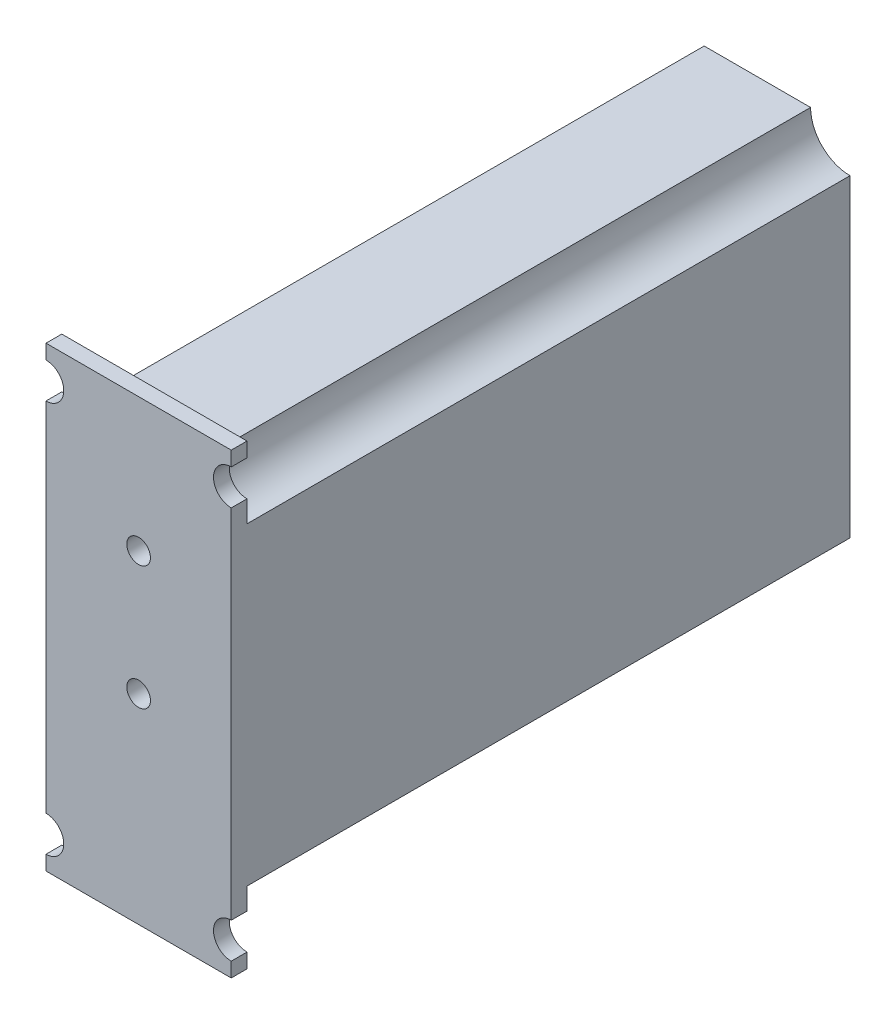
ISO-10303-21;
HEADER;
FILE_DESCRIPTION(('STEP AP214'),'2;1');
FILE_NAME('part.step','',(''),(''),'','','');
FILE_SCHEMA(('AUTOMOTIVE_DESIGN { 1 0 10303 214 1 1 1 1 }'));
ENDSEC;
DATA;
#1=APPLICATION_CONTEXT('core data for automotive mechanical design processes');
#2=APPLICATION_PROTOCOL_DEFINITION('international standard','automotive_design',2000,#1);
#3=PRODUCT_CONTEXT('',#1,'mechanical');
#4=PRODUCT('Part','Part','',(#3));
#5=PRODUCT_RELATED_PRODUCT_CATEGORY('part','',(#4));
#6=PRODUCT_DEFINITION_FORMATION('','',#4);
#7=PRODUCT_DEFINITION_CONTEXT('part definition',#1,'design');
#8=PRODUCT_DEFINITION('design','',#6,#7);
#9=PRODUCT_DEFINITION_SHAPE('','',#8);
#10=(LENGTH_UNIT() NAMED_UNIT(*) SI_UNIT(.MILLI.,.METRE.));
#11=(NAMED_UNIT(*) PLANE_ANGLE_UNIT() SI_UNIT($,.RADIAN.));
#12=(NAMED_UNIT(*) SI_UNIT($,.STERADIAN.) SOLID_ANGLE_UNIT());
#13=UNCERTAINTY_MEASURE_WITH_UNIT(LENGTH_MEASURE(1.E-05),#10,'distance_accuracy_value','');
#14=(GEOMETRIC_REPRESENTATION_CONTEXT(3) GLOBAL_UNCERTAINTY_ASSIGNED_CONTEXT((#13)) GLOBAL_UNIT_ASSIGNED_CONTEXT((#10,
#11,#12)) REPRESENTATION_CONTEXT('',''));
#15=CARTESIAN_POINT('',(0.,0.,0.));
#16=DIRECTION('',(0.,0.,1.));
#17=DIRECTION('',(1.,0.,0.));
#18=AXIS2_PLACEMENT_3D('',#15,#16,#17);
#19=CARTESIAN_POINT('',(-5.96899999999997,12.6492,38.862));
#20=DIRECTION('',(1.,0.,0.));
#21=DIRECTION('',(0.,0.,-0.999999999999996));
#22=AXIS2_PLACEMENT_3D('',#19,#20,#21);
#23=PLANE('',#22);
#24=DIRECTION('',(0.,-1.,0.));
#25=VECTOR('',#24,1.);
#26=CARTESIAN_POINT('',(-5.969,14.7319999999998,39.8779999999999));
#27=LINE('',#26,#25);
#28=CARTESIAN_POINT('',(-5.969,-13.7922,39.878));
#29=VERTEX_POINT('',#28);
#30=CARTESIAN_POINT('',(-5.969,-14.732,39.878));
#31=VERTEX_POINT('',#30);
#32=EDGE_CURVE('E339',#29,#31,#27,.T.);
#33=ORIENTED_EDGE('',*,*,#32,.F.);
#34=DIRECTION('',(0.,0.,-0.999999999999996));
#35=VECTOR('',#34,1.);
#36=CARTESIAN_POINT('',(-5.969,-13.7922,46.482));
#37=LINE('',#36,#35);
#38=CARTESIAN_POINT('',(-5.969,-13.7921999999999,38.862));
#39=VERTEX_POINT('',#38);
#40=EDGE_CURVE('E46',#29,#39,#37,.T.);
#41=ORIENTED_EDGE('',*,*,#40,.T.);
#42=DIRECTION('',(0.,-1.,0.));
#43=VECTOR('',#42,1.);
#44=CARTESIAN_POINT('',(-5.969,14.7319999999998,38.862));
#45=LINE('',#44,#43);
#46=CARTESIAN_POINT('',(-5.969,-14.732,38.862));
#47=VERTEX_POINT('',#46);
#48=EDGE_CURVE('E34',#39,#47,#45,.T.);
#49=ORIENTED_EDGE('',*,*,#48,.T.);
#50=DIRECTION('',(0.,0.,-0.999999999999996));
#51=VECTOR('',#50,1.);
#52=CARTESIAN_POINT('',(-5.969,-14.732,39.878));
#53=LINE('',#52,#51);
#54=EDGE_CURVE('E322',#31,#47,#53,.T.);
#55=ORIENTED_EDGE('',*,*,#54,.F.);
#56=EDGE_LOOP('',(#33,#41,#49,#55));
#57=FACE_BOUND('',#56,.T.);
#58=ADVANCED_FACE('F30',(#57),#23,.F.);
#59=CARTESIAN_POINT('',(5.969,12.6492,38.8619999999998));
#60=DIRECTION('',(-1.,0.,0.));
#61=DIRECTION('',(0.,0.,0.999999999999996));
#62=AXIS2_PLACEMENT_3D('',#59,#60,#61);
#63=PLANE('',#62);
#64=DIRECTION('',(0.,1.,0.));
#65=VECTOR('',#64,1.);
#66=CARTESIAN_POINT('',(5.969,14.732,39.8779999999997));
#67=LINE('',#66,#65);
#68=CARTESIAN_POINT('',(5.969,-11.5062,39.8779999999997));
#69=VERTEX_POINT('',#68);
#70=CARTESIAN_POINT('',(5.969,11.5062,39.8779999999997));
#71=VERTEX_POINT('',#70);
#72=EDGE_CURVE('E348',#69,#71,#67,.T.);
#73=ORIENTED_EDGE('',*,*,#72,.F.);
#74=DIRECTION('',(0.,0.,-0.999999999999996));
#75=VECTOR('',#74,1.);
#76=CARTESIAN_POINT('',(5.969,-11.5062,46.4819999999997));
#77=LINE('',#76,#75);
#78=CARTESIAN_POINT('',(5.96899999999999,-11.5062,38.8619999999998));
#79=VERTEX_POINT('',#78);
#80=EDGE_CURVE('E54',#69,#79,#77,.T.);
#81=ORIENTED_EDGE('',*,*,#80,.T.);
#82=DIRECTION('',(0.,1.,0.));
#83=VECTOR('',#82,1.);
#84=CARTESIAN_POINT('',(5.969,14.732,38.8619999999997));
#85=LINE('',#84,#83);
#86=CARTESIAN_POINT('',(5.96899999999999,-10.1092,38.8619999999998));
#87=VERTEX_POINT('',#86);
#88=EDGE_CURVE('E212',#79,#87,#85,.T.);
#89=ORIENTED_EDGE('',*,*,#88,.T.);
#90=DIRECTION('',(0.,0.,-0.999999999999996));
#91=VECTOR('',#90,1.);
#92=CARTESIAN_POINT('',(5.96899999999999,-10.1092,38.8619999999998));
#93=LINE('',#92,#91);
#94=CARTESIAN_POINT('',(5.96899999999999,-10.1092,0.));
#95=VERTEX_POINT('',#94);
#96=EDGE_CURVE('E238',#87,#95,#93,.T.);
#97=ORIENTED_EDGE('',*,*,#96,.T.);
#98=DIRECTION('',(0.,1.,0.));
#99=VECTOR('',#98,1.);
#100=CARTESIAN_POINT('',(5.969,12.6492,0.));
#101=LINE('',#100,#99);
#102=CARTESIAN_POINT('',(5.969,10.1092,0.));
#103=VERTEX_POINT('',#102);
#104=EDGE_CURVE('E247',#95,#103,#101,.T.);
#105=ORIENTED_EDGE('',*,*,#104,.T.);
#106=DIRECTION('',(0.,0.,-0.999999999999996));
#107=VECTOR('',#106,1.);
#108=CARTESIAN_POINT('',(5.96899999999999,10.1092,38.8619999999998));
#109=LINE('',#108,#107);
#110=CARTESIAN_POINT('',(5.96899999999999,10.1092,38.8619999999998));
#111=VERTEX_POINT('',#110);
#112=EDGE_CURVE('E244',#103,#111,#109,.F.);
#113=ORIENTED_EDGE('',*,*,#112,.T.);
#114=CARTESIAN_POINT('',(5.969,11.5062,38.8619999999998));
#115=VERTEX_POINT('',#114);
#116=EDGE_CURVE('E214',#111,#115,#85,.T.);
#117=ORIENTED_EDGE('',*,*,#116,.T.);
#118=DIRECTION('',(0.,0.,-0.999999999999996));
#119=VECTOR('',#118,1.);
#120=CARTESIAN_POINT('',(5.969,11.5062,46.4819999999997));
#121=LINE('',#120,#119);
#122=EDGE_CURVE('E354',#115,#71,#121,.F.);
#123=ORIENTED_EDGE('',*,*,#122,.T.);
#124=EDGE_LOOP('',(#73,#81,#89,#97,#105,#113,#117,#123));
#125=FACE_BOUND('',#124,.T.);
#126=ADVANCED_FACE('F406',(#125),#63,.F.);
#127=CARTESIAN_POINT('',(-5.96899999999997,-10.1092000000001,38.862));
#128=VERTEX_POINT('',#127);
#129=CARTESIAN_POINT('',(-5.969,-11.5062,38.862));
#130=VERTEX_POINT('',#129);
#131=EDGE_CURVE('E180',#128,#130,#45,.T.);
#132=ORIENTED_EDGE('',*,*,#131,.T.);
#133=DIRECTION('',(0.,0.,-0.999999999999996));
#134=VECTOR('',#133,1.);
#135=CARTESIAN_POINT('',(-5.969,-11.5062,46.482));
#136=LINE('',#135,#134);
#137=CARTESIAN_POINT('',(-5.969,-11.5062,39.878));
#138=VERTEX_POINT('',#137);
#139=EDGE_CURVE('E166',#130,#138,#136,.F.);
#140=ORIENTED_EDGE('',*,*,#139,.T.);
#141=CARTESIAN_POINT('',(-5.969,11.5062,39.878));
#142=VERTEX_POINT('',#141);
#143=EDGE_CURVE('E338',#142,#138,#27,.T.);
#144=ORIENTED_EDGE('',*,*,#143,.F.);
#145=DIRECTION('',(0.,0.,-0.999999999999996));
#146=VECTOR('',#145,1.);
#147=CARTESIAN_POINT('',(-5.969,11.5062,46.4819999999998));
#148=LINE('',#147,#146);
#149=CARTESIAN_POINT('',(-5.969,11.5062,38.862));
#150=VERTEX_POINT('',#149);
#151=EDGE_CURVE('E359',#142,#150,#148,.T.);
#152=ORIENTED_EDGE('',*,*,#151,.T.);
#153=CARTESIAN_POINT('',(-5.969,10.1092,38.862));
#154=VERTEX_POINT('',#153);
#155=EDGE_CURVE('E188',#150,#154,#45,.T.);
#156=ORIENTED_EDGE('',*,*,#155,.T.);
#157=DIRECTION('',(0.,0.,-0.999999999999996));
#158=VECTOR('',#157,1.);
#159=CARTESIAN_POINT('',(-5.969,10.1092,38.862));
#160=LINE('',#159,#158);
#161=CARTESIAN_POINT('',(-5.969,10.1092,0.));
#162=VERTEX_POINT('',#161);
#163=EDGE_CURVE('E259',#154,#162,#160,.T.);
#164=ORIENTED_EDGE('',*,*,#163,.T.);
#165=DIRECTION('',(0.,-1.,0.));
#166=VECTOR('',#165,1.);
#167=CARTESIAN_POINT('',(-5.96899999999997,12.6492,0.));
#168=LINE('',#167,#166);
#169=CARTESIAN_POINT('',(-5.96899999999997,-10.1092000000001,0.));
#170=VERTEX_POINT('',#169);
#171=EDGE_CURVE('E284',#162,#170,#168,.T.);
#172=ORIENTED_EDGE('',*,*,#171,.T.);
#173=DIRECTION('',(0.,0.,-0.999999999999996));
#174=VECTOR('',#173,1.);
#175=CARTESIAN_POINT('',(-5.96899999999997,-10.1092000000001,38.862));
#176=LINE('',#175,#174);
#177=EDGE_CURVE('E187',#170,#128,#176,.F.);
#178=ORIENTED_EDGE('',*,*,#177,.T.);
#179=EDGE_LOOP('',(#132,#140,#144,#152,#156,#164,#172,#178));
#180=FACE_BOUND('',#179,.T.);
#181=ADVANCED_FACE('F185',(#180),#23,.F.);
#182=CARTESIAN_POINT('',(5.96899999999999,13.7921999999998,39.8779999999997));
#183=VERTEX_POINT('',#182);
#184=CARTESIAN_POINT('',(5.969,14.732,39.8779999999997));
#185=VERTEX_POINT('',#184);
#186=EDGE_CURVE('E350',#183,#185,#67,.T.);
#187=ORIENTED_EDGE('',*,*,#186,.F.);
#188=DIRECTION('',(0.,0.,-0.999999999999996));
#189=VECTOR('',#188,1.);
#190=CARTESIAN_POINT('',(5.96899999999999,13.7921999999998,46.4819999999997));
#191=LINE('',#190,#189);
#192=CARTESIAN_POINT('',(5.969,13.7921999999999,38.8619999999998));
#193=VERTEX_POINT('',#192);
#194=EDGE_CURVE('E226',#183,#193,#191,.T.);
#195=ORIENTED_EDGE('',*,*,#194,.T.);
#196=CARTESIAN_POINT('',(5.969,14.732,38.8619999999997));
#197=VERTEX_POINT('',#196);
#198=EDGE_CURVE('E224',#193,#197,#85,.T.);
#199=ORIENTED_EDGE('',*,*,#198,.T.);
#200=DIRECTION('',(0.,0.,-0.999999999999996));
#201=VECTOR('',#200,1.);
#202=CARTESIAN_POINT('',(5.969,14.732,39.8779999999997));
#203=LINE('',#202,#201);
#204=EDGE_CURVE('E313',#185,#197,#203,.T.);
#205=ORIENTED_EDGE('',*,*,#204,.F.);
#206=EDGE_LOOP('',(#187,#195,#199,#205));
#207=FACE_BOUND('',#206,.T.);
#208=ADVANCED_FACE('F436',(#207),#63,.F.);
#209=CARTESIAN_POINT('',(5.96899999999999,-14.732,38.8619999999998));
#210=VERTEX_POINT('',#209);
#211=CARTESIAN_POINT('',(5.96899999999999,-13.7922000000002,38.8619999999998));
#212=VERTEX_POINT('',#211);
#213=EDGE_CURVE('E213',#210,#212,#85,.T.);
#214=ORIENTED_EDGE('',*,*,#213,.T.);
#215=DIRECTION('',(0.,0.,-0.999999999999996));
#216=VECTOR('',#215,1.);
#217=CARTESIAN_POINT('',(5.96899999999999,-13.7922000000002,46.4819999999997));
#218=LINE('',#217,#216);
#219=CARTESIAN_POINT('',(5.96899999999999,-13.7922000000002,39.8779999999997));
#220=VERTEX_POINT('',#219);
#221=EDGE_CURVE('E367',#212,#220,#218,.F.);
#222=ORIENTED_EDGE('',*,*,#221,.T.);
#223=CARTESIAN_POINT('',(5.96899999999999,-14.732,39.8779999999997));
#224=VERTEX_POINT('',#223);
#225=EDGE_CURVE('E346',#224,#220,#67,.T.);
#226=ORIENTED_EDGE('',*,*,#225,.F.);
#227=DIRECTION('',(0.,0.,-0.999999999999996));
#228=VECTOR('',#227,1.);
#229=CARTESIAN_POINT('',(5.96899999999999,-14.732,39.8779999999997));
#230=LINE('',#229,#228);
#231=EDGE_CURVE('E326',#224,#210,#230,.T.);
#232=ORIENTED_EDGE('',*,*,#231,.T.);
#233=EDGE_LOOP('',(#214,#222,#226,#232));
#234=FACE_BOUND('',#233,.T.);
#235=ADVANCED_FACE('F32',(#234),#63,.F.);
#236=CARTESIAN_POINT('',(-5.96899999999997,12.6492,38.862));
#237=DIRECTION('',(0.,-1.,0.));
#238=DIRECTION('',(0.,0.,-0.999999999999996));
#239=AXIS2_PLACEMENT_3D('',#236,#237,#238);
#240=PLANE('',#239);
#241=DIRECTION('',(-1.,0.,0.));
#242=VECTOR('',#241,1.);
#243=CARTESIAN_POINT('',(-5.96899999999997,12.6492,0.));
#244=LINE('',#243,#242);
#245=CARTESIAN_POINT('',(3.429,12.6492,0.));
#246=VERTEX_POINT('',#245);
#247=CARTESIAN_POINT('',(-3.429,12.6492,0.));
#248=VERTEX_POINT('',#247);
#249=EDGE_CURVE('E281',#246,#248,#244,.T.);
#250=ORIENTED_EDGE('',*,*,#249,.T.);
#251=DIRECTION('',(0.,0.,-0.999999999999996));
#252=VECTOR('',#251,1.);
#253=CARTESIAN_POINT('',(-3.429,12.6492,38.862));
#254=LINE('',#253,#252);
#255=CARTESIAN_POINT('',(-3.429,12.6492,38.862));
#256=VERTEX_POINT('',#255);
#257=EDGE_CURVE('E254',#248,#256,#254,.F.);
#258=ORIENTED_EDGE('',*,*,#257,.T.);
#259=DIRECTION('',(-1.,0.,0.));
#260=VECTOR('',#259,1.);
#261=CARTESIAN_POINT('',(-5.96899999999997,12.6492,38.862));
#262=LINE('',#261,#260);
#263=CARTESIAN_POINT('',(3.429,12.6492,38.862));
#264=VERTEX_POINT('',#263);
#265=EDGE_CURVE('E273',#264,#256,#262,.T.);
#266=ORIENTED_EDGE('',*,*,#265,.F.);
#267=DIRECTION('',(0.,0.,-0.999999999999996));
#268=VECTOR('',#267,1.);
#269=CARTESIAN_POINT('',(3.429,12.6492,38.862));
#270=LINE('',#269,#268);
#271=EDGE_CURVE('E248',#264,#246,#270,.T.);
#272=ORIENTED_EDGE('',*,*,#271,.T.);
#273=EDGE_LOOP('',(#250,#258,#266,#272));
#274=FACE_BOUND('',#273,.T.);
#275=ADVANCED_FACE('F441',(#274),#240,.F.);
#276=CARTESIAN_POINT('',(-5.969,14.7319999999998,38.862));
#277=VERTEX_POINT('',#276);
#278=CARTESIAN_POINT('',(-5.96900000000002,13.7922,38.862));
#279=VERTEX_POINT('',#278);
#280=EDGE_CURVE('E190',#277,#279,#45,.T.);
#281=ORIENTED_EDGE('',*,*,#280,.T.);
#282=DIRECTION('',(0.,0.,-0.999999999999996));
#283=VECTOR('',#282,1.);
#284=CARTESIAN_POINT('',(-5.969,13.7922,46.4819999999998));
#285=LINE('',#284,#283);
#286=CARTESIAN_POINT('',(-5.96900000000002,13.7922,39.8779999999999));
#287=VERTEX_POINT('',#286);
#288=EDGE_CURVE('E361',#279,#287,#285,.F.);
#289=ORIENTED_EDGE('',*,*,#288,.T.);
#290=CARTESIAN_POINT('',(-5.969,14.7319999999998,39.8779999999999));
#291=VERTEX_POINT('',#290);
#292=EDGE_CURVE('E333',#291,#287,#27,.T.);
#293=ORIENTED_EDGE('',*,*,#292,.F.);
#294=DIRECTION('',(0.,0.,-0.999999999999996));
#295=VECTOR('',#294,1.);
#296=CARTESIAN_POINT('',(-5.969,14.7319999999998,39.8779999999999));
#297=LINE('',#296,#295);
#298=EDGE_CURVE('E317',#291,#277,#297,.T.);
#299=ORIENTED_EDGE('',*,*,#298,.T.);
#300=EDGE_LOOP('',(#281,#289,#293,#299));
#301=FACE_BOUND('',#300,.T.);
#302=ADVANCED_FACE('F413',(#301),#23,.F.);
#303=CARTESIAN_POINT('',(-5.96899999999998,-12.6492,38.862));
#304=DIRECTION('',(0.,1.,0.));
#305=DIRECTION('',(0.,0.,0.999999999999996));
#306=AXIS2_PLACEMENT_3D('',#303,#304,#305);
#307=PLANE('',#306);
#308=DIRECTION('',(1.,0.,0.));
#309=VECTOR('',#308,1.);
#310=CARTESIAN_POINT('',(-5.96899999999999,-12.6492,0.));
#311=LINE('',#310,#309);
#312=CARTESIAN_POINT('',(-3.429,-12.6491999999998,2.22044604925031E-13));
#313=VERTEX_POINT('',#312);
#314=CARTESIAN_POINT('',(3.429,-12.6492,0.));
#315=VERTEX_POINT('',#314);
#316=EDGE_CURVE('E277',#313,#315,#311,.T.);
#317=ORIENTED_EDGE('',*,*,#316,.T.);
#318=DIRECTION('',(0.,0.,-0.999999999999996));
#319=VECTOR('',#318,1.);
#320=CARTESIAN_POINT('',(3.429,-12.6492,38.862));
#321=LINE('',#320,#319);
#322=CARTESIAN_POINT('',(3.429,-12.6492,38.862));
#323=VERTEX_POINT('',#322);
#324=EDGE_CURVE('E234',#315,#323,#321,.F.);
#325=ORIENTED_EDGE('',*,*,#324,.T.);
#326=DIRECTION('',(1.,0.,0.));
#327=VECTOR('',#326,1.);
#328=CARTESIAN_POINT('',(-5.96899999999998,-12.6492,38.862));
#329=LINE('',#328,#327);
#330=CARTESIAN_POINT('',(-3.429,-12.6491999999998,38.862));
#331=VERTEX_POINT('',#330);
#332=EDGE_CURVE('E276',#331,#323,#329,.T.);
#333=ORIENTED_EDGE('',*,*,#332,.F.);
#334=DIRECTION('',(0.,0.,-0.999999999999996));
#335=VECTOR('',#334,1.);
#336=CARTESIAN_POINT('',(-3.429,-12.6491999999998,38.862));
#337=LINE('',#336,#335);
#338=EDGE_CURVE('E266',#331,#313,#337,.T.);
#339=ORIENTED_EDGE('',*,*,#338,.T.);
#340=EDGE_LOOP('',(#317,#325,#333,#339));
#341=FACE_BOUND('',#340,.T.);
#342=ADVANCED_FACE('F440',(#341),#307,.F.);
#343=CARTESIAN_POINT('',(5.96899999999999,-12.6492,0.));
#344=DIRECTION('',(0.,0.,0.999999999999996));
#345=DIRECTION('',(1.,0.,0.));
#346=AXIS2_PLACEMENT_3D('',#343,#344,#345);
#347=PLANE('',#346);
#348=ORIENTED_EDGE('',*,*,#104,.F.);
#349=CARTESIAN_POINT('',(5.96899999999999,-12.6492,0.));
#350=DIRECTION('',(0.,0.,-0.999999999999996));
#351=DIRECTION('',(1.,0.,0.));
#352=AXIS2_PLACEMENT_3D('',#349,#350,#351);
#353=CIRCLE('',#352,2.54);
#354=EDGE_CURVE('E235',#315,#95,#353,.T.);
#355=ORIENTED_EDGE('',*,*,#354,.F.);
#356=ORIENTED_EDGE('',*,*,#316,.F.);
#357=CARTESIAN_POINT('',(-5.96899999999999,-12.6492,0.));
#358=DIRECTION('',(0.,0.,-0.999999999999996));
#359=DIRECTION('',(-1.,0.,0.));
#360=AXIS2_PLACEMENT_3D('',#357,#358,#359);
#361=CIRCLE('',#360,2.54);
#362=EDGE_CURVE('E241',#170,#313,#361,.T.);
#363=ORIENTED_EDGE('',*,*,#362,.F.);
#364=ORIENTED_EDGE('',*,*,#171,.F.);
#365=CARTESIAN_POINT('',(-5.96899999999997,12.6492,0.));
#366=DIRECTION('',(0.,0.,-0.999999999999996));
#367=DIRECTION('',(1.,0.,0.));
#368=AXIS2_PLACEMENT_3D('',#365,#366,#367);
#369=CIRCLE('',#368,2.54);
#370=EDGE_CURVE('E260',#248,#162,#369,.T.);
#371=ORIENTED_EDGE('',*,*,#370,.F.);
#372=ORIENTED_EDGE('',*,*,#249,.F.);
#373=CARTESIAN_POINT('',(5.969,12.6492,0.));
#374=DIRECTION('',(0.,0.,0.999999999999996));
#375=DIRECTION('',(1.,0.,0.));
#376=AXIS2_PLACEMENT_3D('',#373,#374,#375);
#377=CIRCLE('',#376,2.54);
#378=EDGE_CURVE('E230',#246,#103,#377,.T.);
#379=ORIENTED_EDGE('',*,*,#378,.T.);
#380=EDGE_LOOP('',(#348,#355,#356,#363,#364,#371,#372,#379));
#381=FACE_BOUND('',#380,.T.);
#382=ADVANCED_FACE('F306',(#381),#347,.F.);
#383=CARTESIAN_POINT('',(5.969,12.6492,38.8619999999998));
#384=DIRECTION('',(0.,0.,-0.999999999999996));
#385=DIRECTION('',(-1.,0.,0.));
#386=AXIS2_PLACEMENT_3D('',#383,#384,#385);
#387=CYLINDRICAL_SURFACE('',#386,2.54);
#388=ORIENTED_EDGE('',*,*,#378,.F.);
#389=ORIENTED_EDGE('',*,*,#271,.F.);
#390=CARTESIAN_POINT('',(5.969,12.6492,38.8619999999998));
#391=DIRECTION('',(0.,0.,-0.999999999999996));
#392=DIRECTION('',(-1.,0.,0.));
#393=AXIS2_PLACEMENT_3D('',#390,#391,#392);
#394=CIRCLE('',#393,2.54);
#395=EDGE_CURVE('E251',#111,#264,#394,.T.);
#396=ORIENTED_EDGE('',*,*,#395,.F.);
#397=ORIENTED_EDGE('',*,*,#112,.F.);
#398=EDGE_LOOP('',(#388,#389,#396,#397));
#399=FACE_BOUND('',#398,.T.);
#400=ADVANCED_FACE('F454',(#399),#387,.F.);
#401=CARTESIAN_POINT('',(-5.96899999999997,12.6492,38.862));
#402=DIRECTION('',(0.,0.,-0.999999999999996));
#403=DIRECTION('',(-1.,0.,0.));
#404=AXIS2_PLACEMENT_3D('',#401,#402,#403);
#405=CYLINDRICAL_SURFACE('',#404,2.54);
#406=ORIENTED_EDGE('',*,*,#370,.T.);
#407=ORIENTED_EDGE('',*,*,#163,.F.);
#408=CARTESIAN_POINT('',(-5.96899999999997,12.6492,38.862));
#409=DIRECTION('',(0.,0.,-0.999999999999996));
#410=DIRECTION('',(1.,0.,0.));
#411=AXIS2_PLACEMENT_3D('',#408,#409,#410);
#412=CIRCLE('',#411,2.54);
#413=EDGE_CURVE('E255',#256,#154,#412,.T.);
#414=ORIENTED_EDGE('',*,*,#413,.F.);
#415=ORIENTED_EDGE('',*,*,#257,.F.);
#416=EDGE_LOOP('',(#406,#407,#414,#415));
#417=FACE_BOUND('',#416,.T.);
#418=ADVANCED_FACE('F580',(#417),#405,.F.);
#419=CARTESIAN_POINT('',(-5.96899999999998,-12.6492,38.862));
#420=DIRECTION('',(0.,0.,-0.999999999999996));
#421=DIRECTION('',(-1.,0.,0.));
#422=AXIS2_PLACEMENT_3D('',#419,#420,#421);
#423=CYLINDRICAL_SURFACE('',#422,2.54);
#424=ORIENTED_EDGE('',*,*,#362,.T.);
#425=ORIENTED_EDGE('',*,*,#338,.F.);
#426=CARTESIAN_POINT('',(-5.96899999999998,-12.6492,38.862));
#427=DIRECTION('',(0.,0.,-0.999999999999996));
#428=DIRECTION('',(-1.,0.,0.));
#429=AXIS2_PLACEMENT_3D('',#426,#427,#428);
#430=CIRCLE('',#429,2.54);
#431=EDGE_CURVE('E290',#128,#331,#430,.T.);
#432=ORIENTED_EDGE('',*,*,#431,.F.);
#433=ORIENTED_EDGE('',*,*,#177,.F.);
#434=EDGE_LOOP('',(#424,#425,#432,#433));
#435=FACE_BOUND('',#434,.T.);
#436=ADVANCED_FACE('F577',(#435),#423,.F.);
#437=CARTESIAN_POINT('',(5.96899999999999,-12.6492,38.8619999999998));
#438=DIRECTION('',(0.,0.,-0.999999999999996));
#439=DIRECTION('',(-1.,0.,0.));
#440=AXIS2_PLACEMENT_3D('',#437,#438,#439);
#441=CYLINDRICAL_SURFACE('',#440,2.54);
#442=CARTESIAN_POINT('',(5.96899999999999,-12.6492,38.8619999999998));
#443=DIRECTION('',(0.,0.,-0.999999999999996));
#444=DIRECTION('',(1.,0.,0.));
#445=AXIS2_PLACEMENT_3D('',#442,#443,#444);
#446=CIRCLE('',#445,2.54);
#447=EDGE_CURVE('E231',#323,#87,#446,.T.);
#448=ORIENTED_EDGE('',*,*,#447,.F.);
#449=ORIENTED_EDGE('',*,*,#324,.F.);
#450=ORIENTED_EDGE('',*,*,#354,.T.);
#451=ORIENTED_EDGE('',*,*,#96,.F.);
#452=EDGE_LOOP('',(#448,#449,#450,#451));
#453=FACE_BOUND('',#452,.T.);
#454=ADVANCED_FACE('F475',(#453),#441,.F.);
#455=CARTESIAN_POINT('',(5.96899999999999,-14.732,38.8619999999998));
#456=DIRECTION('',(0.,0.,0.999999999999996));
#457=DIRECTION('',(1.,0.,0.));
#458=AXIS2_PLACEMENT_3D('',#455,#456,#457);
#459=PLANE('',#458);
#460=ORIENTED_EDGE('',*,*,#155,.F.);
#461=CARTESIAN_POINT('',(-5.96899999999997,12.6492,38.862));
#462=DIRECTION('',(0.,0.,-0.999999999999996));
#463=DIRECTION('',(1.,0.,0.));
#464=AXIS2_PLACEMENT_3D('',#461,#462,#463);
#465=CIRCLE('',#464,1.143);
#466=EDGE_CURVE('E364',#279,#150,#465,.T.);
#467=ORIENTED_EDGE('',*,*,#466,.F.);
#468=ORIENTED_EDGE('',*,*,#280,.F.);
#469=DIRECTION('',(-1.,0.,0.));
#470=VECTOR('',#469,1.);
#471=CARTESIAN_POINT('',(-5.969,14.7319999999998,38.862));
#472=LINE('',#471,#470);
#473=EDGE_CURVE('E192',#197,#277,#472,.T.);
#474=ORIENTED_EDGE('',*,*,#473,.F.);
#475=ORIENTED_EDGE('',*,*,#198,.F.);
#476=CARTESIAN_POINT('',(5.969,12.6492,38.8619999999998));
#477=DIRECTION('',(0.,0.,-0.999999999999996));
#478=DIRECTION('',(-1.,0.,0.));
#479=AXIS2_PLACEMENT_3D('',#476,#477,#478);
#480=CIRCLE('',#479,1.143);
#481=EDGE_CURVE('E357',#115,#193,#480,.T.);
#482=ORIENTED_EDGE('',*,*,#481,.F.);
#483=ORIENTED_EDGE('',*,*,#116,.F.);
#484=ORIENTED_EDGE('',*,*,#395,.T.);
#485=ORIENTED_EDGE('',*,*,#265,.T.);
#486=ORIENTED_EDGE('',*,*,#413,.T.);
#487=EDGE_LOOP('',(#460,#467,#468,#474,#475,#482,#483,#484,#485,#486));
#488=FACE_BOUND('',#487,.T.);
#489=ADVANCED_FACE('F417',(#488),#459,.F.);
#490=ORIENTED_EDGE('',*,*,#48,.F.);
#491=CARTESIAN_POINT('',(-5.96899999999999,-12.6492,38.862));
#492=DIRECTION('',(0.,0.,-0.999999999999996));
#493=DIRECTION('',(-1.,0.,0.));
#494=AXIS2_PLACEMENT_3D('',#491,#492,#493);
#495=CIRCLE('',#494,1.143);
#496=EDGE_CURVE('E169',#130,#39,#495,.T.);
#497=ORIENTED_EDGE('',*,*,#496,.F.);
#498=ORIENTED_EDGE('',*,*,#131,.F.);
#499=ORIENTED_EDGE('',*,*,#431,.T.);
#500=ORIENTED_EDGE('',*,*,#332,.T.);
#501=ORIENTED_EDGE('',*,*,#447,.T.);
#502=ORIENTED_EDGE('',*,*,#88,.F.);
#503=CARTESIAN_POINT('',(5.96899999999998,-12.6492,38.8619999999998));
#504=DIRECTION('',(0.,0.,-0.999999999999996));
#505=DIRECTION('',(1.,0.,0.));
#506=AXIS2_PLACEMENT_3D('',#503,#504,#505);
#507=CIRCLE('',#506,1.143);
#508=EDGE_CURVE('E370',#212,#79,#507,.T.);
#509=ORIENTED_EDGE('',*,*,#508,.F.);
#510=ORIENTED_EDGE('',*,*,#213,.F.);
#511=DIRECTION('',(1.,0.,0.));
#512=VECTOR('',#511,1.);
#513=CARTESIAN_POINT('',(-5.969,-14.732,38.862));
#514=LINE('',#513,#512);
#515=EDGE_CURVE('E202',#47,#210,#514,.T.);
#516=ORIENTED_EDGE('',*,*,#515,.F.);
#517=EDGE_LOOP('',(#490,#497,#498,#499,#500,#501,#502,#509,#510,#516));
#518=FACE_BOUND('',#517,.T.);
#519=ADVANCED_FACE('F178',(#518),#459,.F.);
#520=CARTESIAN_POINT('',(-5.969,14.7319999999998,39.8779999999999));
#521=DIRECTION('',(0.,-1.,0.));
#522=DIRECTION('',(0.,0.,-0.999999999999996));
#523=AXIS2_PLACEMENT_3D('',#520,#521,#522);
#524=PLANE('',#523);
#525=ORIENTED_EDGE('',*,*,#473,.T.);
#526=ORIENTED_EDGE('',*,*,#298,.F.);
#527=DIRECTION('',(-1.,0.,0.));
#528=VECTOR('',#527,1.);
#529=CARTESIAN_POINT('',(-5.969,14.7319999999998,39.8779999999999));
#530=LINE('',#529,#528);
#531=EDGE_CURVE('E343',#185,#291,#530,.T.);
#532=ORIENTED_EDGE('',*,*,#531,.F.);
#533=ORIENTED_EDGE('',*,*,#204,.T.);
#534=EDGE_LOOP('',(#525,#526,#532,#533));
#535=FACE_BOUND('',#534,.T.);
#536=ADVANCED_FACE('F497',(#535),#524,.F.);
#537=CARTESIAN_POINT('',(-5.969,-14.732,39.878));
#538=DIRECTION('',(0.,1.,0.));
#539=DIRECTION('',(0.,0.,0.999999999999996));
#540=AXIS2_PLACEMENT_3D('',#537,#538,#539);
#541=PLANE('',#540);
#542=ORIENTED_EDGE('',*,*,#515,.T.);
#543=ORIENTED_EDGE('',*,*,#231,.F.);
#544=DIRECTION('',(1.,0.,0.));
#545=VECTOR('',#544,1.);
#546=CARTESIAN_POINT('',(-5.969,-14.732,39.878));
#547=LINE('',#546,#545);
#548=EDGE_CURVE('E217',#31,#224,#547,.T.);
#549=ORIENTED_EDGE('',*,*,#548,.F.);
#550=ORIENTED_EDGE('',*,*,#54,.T.);
#551=EDGE_LOOP('',(#542,#543,#549,#550));
#552=FACE_BOUND('',#551,.T.);
#553=ADVANCED_FACE('F398',(#552),#541,.F.);
#554=CARTESIAN_POINT('',(5.96899999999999,-14.732,39.8779999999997));
#555=DIRECTION('',(0.,0.,0.999999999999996));
#556=DIRECTION('',(1.,0.,0.));
#557=AXIS2_PLACEMENT_3D('',#554,#555,#556);
#558=PLANE('',#557);
#559=CARTESIAN_POINT('',(0.,-1.85420000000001,39.8779999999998));
#560=DIRECTION('',(0.,0.,0.999999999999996));
#561=DIRECTION('',(-1.,0.,0.));
#562=AXIS2_PLACEMENT_3D('',#559,#560,#561);
#563=CIRCLE('',#562,0.762);
#564=CARTESIAN_POINT('',(0.761999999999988,-1.85419999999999,39.8779999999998));
#565=VERTEX_POINT('',#564);
#566=EDGE_CURVE('E379',#565,#565,#563,.T.);
#567=ORIENTED_EDGE('',*,*,#566,.F.);
#568=EDGE_LOOP('',(#567));
#569=FACE_BOUND('',#568,.T.);
#570=CARTESIAN_POINT('',(0.,6.12139999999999,39.8779999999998));
#571=DIRECTION('',(0.,0.,0.999999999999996));
#572=DIRECTION('',(1.,0.,0.));
#573=AXIS2_PLACEMENT_3D('',#570,#571,#572);
#574=CIRCLE('',#573,0.762);
#575=CARTESIAN_POINT('',(0.762000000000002,6.12140000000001,39.8779999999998));
#576=VERTEX_POINT('',#575);
#577=EDGE_CURVE('E373',#576,#576,#574,.T.);
#578=ORIENTED_EDGE('',*,*,#577,.F.);
#579=EDGE_LOOP('',(#578));
#580=FACE_BOUND('',#579,.T.);
#581=CARTESIAN_POINT('',(-5.96899999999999,-12.6492,39.878));
#582=DIRECTION('',(0.,0.,0.999999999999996));
#583=DIRECTION('',(1.,0.,0.));
#584=AXIS2_PLACEMENT_3D('',#581,#582,#583);
#585=CIRCLE('',#584,1.143);
#586=EDGE_CURVE('E11',#29,#138,#585,.T.);
#587=ORIENTED_EDGE('',*,*,#586,.F.);
#588=ORIENTED_EDGE('',*,*,#32,.T.);
#589=ORIENTED_EDGE('',*,*,#548,.T.);
#590=ORIENTED_EDGE('',*,*,#225,.T.);
#591=CARTESIAN_POINT('',(5.96899999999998,-12.6492,39.8779999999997));
#592=DIRECTION('',(0.,0.,0.999999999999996));
#593=DIRECTION('',(1.,0.,0.));
#594=AXIS2_PLACEMENT_3D('',#591,#592,#593);
#595=CIRCLE('',#594,1.143);
#596=EDGE_CURVE('E40',#69,#220,#595,.T.);
#597=ORIENTED_EDGE('',*,*,#596,.F.);
#598=ORIENTED_EDGE('',*,*,#72,.T.);
#599=CARTESIAN_POINT('',(5.969,12.6492,39.8779999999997));
#600=DIRECTION('',(0.,0.,0.999999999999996));
#601=DIRECTION('',(1.,0.,0.));
#602=AXIS2_PLACEMENT_3D('',#599,#600,#601);
#603=CIRCLE('',#602,1.143);
#604=EDGE_CURVE('E227',#183,#71,#603,.T.);
#605=ORIENTED_EDGE('',*,*,#604,.F.);
#606=ORIENTED_EDGE('',*,*,#186,.T.);
#607=ORIENTED_EDGE('',*,*,#531,.T.);
#608=ORIENTED_EDGE('',*,*,#292,.T.);
#609=CARTESIAN_POINT('',(-5.96899999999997,12.6492,39.878));
#610=DIRECTION('',(0.,0.,0.999999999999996));
#611=DIRECTION('',(1.,0.,0.));
#612=AXIS2_PLACEMENT_3D('',#609,#610,#611);
#613=CIRCLE('',#612,1.143);
#614=EDGE_CURVE('E209',#142,#287,#613,.T.);
#615=ORIENTED_EDGE('',*,*,#614,.F.);
#616=ORIENTED_EDGE('',*,*,#143,.T.);
#617=EDGE_LOOP('',(#587,#588,#589,#590,#597,#598,#605,#606,#607,#608,#615,#616));
#618=FACE_BOUND('',#617,.T.);
#619=ADVANCED_FACE('F394',(#569,#580,#618),#558,.T.);
#620=CARTESIAN_POINT('',(5.969,12.6492,46.4819999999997));
#621=DIRECTION('',(0.,0.,-0.999999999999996));
#622=DIRECTION('',(-1.,0.,0.));
#623=AXIS2_PLACEMENT_3D('',#620,#621,#622);
#624=CYLINDRICAL_SURFACE('',#623,1.143);
#625=ORIENTED_EDGE('',*,*,#604,.T.);
#626=ORIENTED_EDGE('',*,*,#122,.F.);
#627=ORIENTED_EDGE('',*,*,#481,.T.);
#628=ORIENTED_EDGE('',*,*,#194,.F.);
#629=EDGE_LOOP('',(#625,#626,#627,#628));
#630=FACE_BOUND('',#629,.T.);
#631=ADVANCED_FACE('F397',(#630),#624,.F.);
#632=CARTESIAN_POINT('',(-5.96899999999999,12.6492,46.4819999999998));
#633=DIRECTION('',(0.,0.,-0.999999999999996));
#634=DIRECTION('',(-1.,0.,0.));
#635=AXIS2_PLACEMENT_3D('',#632,#633,#634);
#636=CYLINDRICAL_SURFACE('',#635,1.143);
#637=ORIENTED_EDGE('',*,*,#614,.T.);
#638=ORIENTED_EDGE('',*,*,#288,.F.);
#639=ORIENTED_EDGE('',*,*,#466,.T.);
#640=ORIENTED_EDGE('',*,*,#151,.F.);
#641=EDGE_LOOP('',(#637,#638,#639,#640));
#642=FACE_BOUND('',#641,.T.);
#643=ADVANCED_FACE('F420',(#642),#636,.F.);
#644=CARTESIAN_POINT('',(5.96899999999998,-12.6492,46.4819999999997));
#645=DIRECTION('',(0.,0.,-0.999999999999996));
#646=DIRECTION('',(-1.,0.,0.));
#647=AXIS2_PLACEMENT_3D('',#644,#645,#646);
#648=CYLINDRICAL_SURFACE('',#647,1.143);
#649=ORIENTED_EDGE('',*,*,#596,.T.);
#650=ORIENTED_EDGE('',*,*,#221,.F.);
#651=ORIENTED_EDGE('',*,*,#508,.T.);
#652=ORIENTED_EDGE('',*,*,#80,.F.);
#653=EDGE_LOOP('',(#649,#650,#651,#652));
#654=FACE_BOUND('',#653,.T.);
#655=ADVANCED_FACE('F422',(#654),#648,.F.);
#656=CARTESIAN_POINT('',(-5.96900000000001,-12.6492,46.482));
#657=DIRECTION('',(0.,0.,-0.999999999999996));
#658=DIRECTION('',(-1.,0.,0.));
#659=AXIS2_PLACEMENT_3D('',#656,#657,#658);
#660=CYLINDRICAL_SURFACE('',#659,1.143);
#661=ORIENTED_EDGE('',*,*,#586,.T.);
#662=ORIENTED_EDGE('',*,*,#139,.F.);
#663=ORIENTED_EDGE('',*,*,#496,.T.);
#664=ORIENTED_EDGE('',*,*,#40,.F.);
#665=EDGE_LOOP('',(#661,#662,#663,#664));
#666=FACE_BOUND('',#665,.T.);
#667=ADVANCED_FACE('F168',(#666),#660,.F.);
#668=CARTESIAN_POINT('',(0.,6.12140000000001,33.5279999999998));
#669=DIRECTION('',(0.,0.,0.999999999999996));
#670=DIRECTION('',(1.,0.,0.));
#671=AXIS2_PLACEMENT_3D('',#668,#669,#670);
#672=CYLINDRICAL_SURFACE('',#671,0.762);
#673=CARTESIAN_POINT('',(0.,6.12140000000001,33.5279999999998));
#674=DIRECTION('',(0.,0.,0.999999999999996));
#675=DIRECTION('',(1.,0.,0.));
#676=AXIS2_PLACEMENT_3D('',#673,#674,#675);
#677=CIRCLE('',#676,0.762);
#678=CARTESIAN_POINT('',(0.762000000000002,6.12140000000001,33.5279999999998));
#679=VERTEX_POINT('',#678);
#680=EDGE_CURVE('E182',#679,#679,#677,.T.);
#681=CARTESIAN_POINT('',(0.762000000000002,6.12140000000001,33.5279999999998));
#682=CARTESIAN_POINT('',(0.762000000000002,6.12140000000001,33.5941458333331));
#683=CARTESIAN_POINT('',(0.762000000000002,6.12140000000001,33.6602916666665));
#684=CARTESIAN_POINT('',(0.762000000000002,6.12140000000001,33.7925833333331));
#685=CARTESIAN_POINT('',(0.762000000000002,6.12140000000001,33.8587291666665));
#686=CARTESIAN_POINT('',(0.762000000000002,6.12140000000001,33.9910208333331));
#687=CARTESIAN_POINT('',(0.762000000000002,6.12140000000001,34.0571666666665));
#688=CARTESIAN_POINT('',(0.762000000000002,6.12140000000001,34.1894583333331));
#689=CARTESIAN_POINT('',(0.762000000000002,6.12140000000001,34.2556041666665));
#690=CARTESIAN_POINT('',(0.762000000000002,6.12140000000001,34.3878958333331));
#691=CARTESIAN_POINT('',(0.762000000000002,6.12140000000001,34.4540416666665));
#692=CARTESIAN_POINT('',(0.762000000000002,6.12140000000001,34.5863333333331));
#693=CARTESIAN_POINT('',(0.762000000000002,6.12140000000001,34.6524791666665));
#694=CARTESIAN_POINT('',(0.762000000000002,6.12140000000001,34.7847708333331));
#695=CARTESIAN_POINT('',(0.762000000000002,6.12140000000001,34.8509166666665));
#696=CARTESIAN_POINT('',(0.762000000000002,6.12140000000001,34.9832083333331));
#697=CARTESIAN_POINT('',(0.762000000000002,6.12140000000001,35.0493541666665));
#698=CARTESIAN_POINT('',(0.762000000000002,6.12140000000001,35.1816458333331));
#699=CARTESIAN_POINT('',(0.762000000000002,6.12140000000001,35.2477916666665));
#700=CARTESIAN_POINT('',(0.762000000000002,6.12140000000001,35.3800833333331));
#701=CARTESIAN_POINT('',(0.762000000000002,6.12140000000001,35.4462291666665));
#702=CARTESIAN_POINT('',(0.762000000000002,6.12140000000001,35.5785208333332));
#703=CARTESIAN_POINT('',(0.762000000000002,6.12140000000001,35.6446666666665));
#704=CARTESIAN_POINT('',(0.762000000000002,6.12140000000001,35.7769583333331));
#705=CARTESIAN_POINT('',(0.762000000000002,6.12140000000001,35.8431041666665));
#706=CARTESIAN_POINT('',(0.762000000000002,6.12140000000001,35.9753958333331));
#707=CARTESIAN_POINT('',(0.762000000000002,6.12140000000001,36.0415416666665));
#708=CARTESIAN_POINT('',(0.762000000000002,6.12140000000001,36.1738333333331));
#709=CARTESIAN_POINT('',(0.762000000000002,6.12140000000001,36.2399791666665));
#710=CARTESIAN_POINT('',(0.762000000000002,6.12140000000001,36.3722708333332));
#711=CARTESIAN_POINT('',(0.762000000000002,6.12140000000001,36.4384166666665));
#712=CARTESIAN_POINT('',(0.762000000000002,6.12140000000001,36.5707083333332));
#713=CARTESIAN_POINT('',(0.762000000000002,6.12140000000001,36.6368541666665));
#714=CARTESIAN_POINT('',(0.762000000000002,6.12140000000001,36.7691458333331));
#715=CARTESIAN_POINT('',(0.762000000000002,6.12140000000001,36.8352916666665));
#716=CARTESIAN_POINT('',(0.762000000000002,6.12140000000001,36.9675833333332));
#717=CARTESIAN_POINT('',(0.762000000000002,6.12140000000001,37.0337291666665));
#718=CARTESIAN_POINT('',(0.762000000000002,6.12140000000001,37.1660208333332));
#719=CARTESIAN_POINT('',(0.762000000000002,6.12140000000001,37.2321666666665));
#720=CARTESIAN_POINT('',(0.762000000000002,6.12140000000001,37.3644583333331));
#721=CARTESIAN_POINT('',(0.762000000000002,6.12140000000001,37.4306041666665));
#722=CARTESIAN_POINT('',(0.762000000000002,6.12140000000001,37.5628958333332));
#723=CARTESIAN_POINT('',(0.762000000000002,6.12140000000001,37.6290416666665));
#724=CARTESIAN_POINT('',(0.762000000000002,6.12140000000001,37.7613333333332));
#725=CARTESIAN_POINT('',(0.762000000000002,6.12140000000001,37.8274791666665));
#726=CARTESIAN_POINT('',(0.762000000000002,6.12140000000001,37.9597708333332));
#727=CARTESIAN_POINT('',(0.762000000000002,6.12140000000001,38.0259166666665));
#728=CARTESIAN_POINT('',(0.762000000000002,6.12140000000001,38.1582083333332));
#729=CARTESIAN_POINT('',(0.762000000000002,6.12140000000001,38.2243541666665));
#730=CARTESIAN_POINT('',(0.762000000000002,6.12140000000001,38.3566458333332));
#731=CARTESIAN_POINT('',(0.762000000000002,6.12140000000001,38.4227916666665));
#732=CARTESIAN_POINT('',(0.762000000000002,6.12140000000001,38.5550833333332));
#733=CARTESIAN_POINT('',(0.762000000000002,6.12140000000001,38.6212291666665));
#734=CARTESIAN_POINT('',(0.762000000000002,6.12140000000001,38.7535208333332));
#735=CARTESIAN_POINT('',(0.762000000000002,6.12140000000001,38.8196666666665));
#736=CARTESIAN_POINT('',(0.762000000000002,6.12140000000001,38.9519583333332));
#737=CARTESIAN_POINT('',(0.762000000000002,6.12140000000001,39.0181041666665));
#738=CARTESIAN_POINT('',(0.762000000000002,6.12140000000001,39.1503958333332));
#739=CARTESIAN_POINT('',(0.762000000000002,6.12140000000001,39.2165416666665));
#740=CARTESIAN_POINT('',(0.762000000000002,6.12140000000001,39.3488333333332));
#741=CARTESIAN_POINT('',(0.762000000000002,6.12140000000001,39.4149791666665));
#742=CARTESIAN_POINT('',(0.762000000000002,6.12140000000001,39.5472708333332));
#743=CARTESIAN_POINT('',(0.762000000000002,6.12140000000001,39.6134166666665));
#744=CARTESIAN_POINT('',(0.762000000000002,6.12140000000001,39.7457083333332));
#745=CARTESIAN_POINT('',(0.762000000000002,6.12140000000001,39.8118541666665));
#746=CARTESIAN_POINT('',(0.762000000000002,6.12140000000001,39.8779999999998));
#747=B_SPLINE_CURVE_WITH_KNOTS('',3,(#681,#682,#683,#684,#685,#686,#687,#688,#689,#690,#691,
#692,#693,#694,#695,#696,#697,#698,#699,#700,#701,#702,#703,#704,#705,#706,#707,#708,#709,#710,
#711,#712,#713,#714,#715,#716,#717,#718,#719,#720,#721,#722,#723,#724,#725,#726,#727,#728,#729,
#730,#731,#732,#733,#734,#735,#736,#737,#738,#739,#740,#741,#742,#743,#744,#745,#746),
.UNSPECIFIED.,.F.,.F.,(4,2,2,2,2,2,2,2,2,2,2,2,2,2,2,2,2,2,2,2,2,2,2,2,2,2,2,2,2,2,2,2,4),(0.,
0.198437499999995,0.396874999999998,0.5953125,0.793749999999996,0.992187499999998,1.190625,
1.3890625,1.58750000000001,1.7859375,1.984375,2.18281250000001,2.38125,2.5796875,
2.77812500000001,2.97656250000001,3.17500000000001,3.37343750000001,3.57187500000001,
3.77031250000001,3.96875000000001,4.16718750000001,4.36562500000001,4.56406250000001,
4.76250000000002,4.96093750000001,5.15937500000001,5.35781250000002,5.55625000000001,
5.75468750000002,5.95312500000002,6.15156250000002,6.35000000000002),.UNSPECIFIED.);
#748=EDGE_CURVE('BSEAM534',#679,#576,#747,.T.);
#749=ORIENTED_EDGE('',*,*,#680,.F.);
#750=ORIENTED_EDGE('',*,*,#577,.T.);
#751=ORIENTED_EDGE('',*,*,#748,.T.);
#752=ORIENTED_EDGE('',*,*,#748,.F.);
#753=EDGE_LOOP('',(#749,#751,#750,#752));
#754=FACE_BOUND('',#753,.T.);
#755=ADVANCED_FACE('F534',(#754),#672,.F.);
#756=CARTESIAN_POINT('',(0.,6.12140000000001,33.5279999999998));
#757=DIRECTION('',(0.,0.,0.999999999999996));
#758=DIRECTION('',(1.,0.,0.));
#759=AXIS2_PLACEMENT_3D('',#756,#757,#758);
#760=PLANE('',#759);
#761=ORIENTED_EDGE('',*,*,#680,.T.);
#762=EDGE_LOOP('',(#761));
#763=FACE_BOUND('',#762,.T.);
#764=ADVANCED_FACE('F390',(#763),#760,.T.);
#765=CARTESIAN_POINT('',(0.,-1.85419999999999,33.5279999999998));
#766=DIRECTION('',(0.,0.,0.999999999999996));
#767=DIRECTION('',(1.,0.,0.));
#768=AXIS2_PLACEMENT_3D('',#765,#766,#767);
#769=CYLINDRICAL_SURFACE('',#768,0.762);
#770=CARTESIAN_POINT('',(0.,-1.85419999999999,33.5279999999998));
#771=DIRECTION('',(0.,0.,0.999999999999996));
#772=DIRECTION('',(-1.,0.,0.));
#773=AXIS2_PLACEMENT_3D('',#770,#771,#772);
#774=CIRCLE('',#773,0.762);
#775=CARTESIAN_POINT('',(0.761999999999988,-1.85419999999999,33.5279999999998));
#776=VERTEX_POINT('',#775);
#777=EDGE_CURVE('E376',#776,#776,#774,.T.);
#778=CARTESIAN_POINT('',(0.761999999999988,-1.85419999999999,33.5279999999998));
#779=CARTESIAN_POINT('',(0.761999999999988,-1.85419999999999,33.5941458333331));
#780=CARTESIAN_POINT('',(0.761999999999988,-1.85419999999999,33.6602916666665));
#781=CARTESIAN_POINT('',(0.761999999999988,-1.85419999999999,33.7925833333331));
#782=CARTESIAN_POINT('',(0.761999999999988,-1.85419999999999,33.8587291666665));
#783=CARTESIAN_POINT('',(0.761999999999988,-1.85419999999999,33.9910208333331));
#784=CARTESIAN_POINT('',(0.761999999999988,-1.85419999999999,34.0571666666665));
#785=CARTESIAN_POINT('',(0.761999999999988,-1.85419999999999,34.1894583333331));
#786=CARTESIAN_POINT('',(0.761999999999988,-1.85419999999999,34.2556041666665));
#787=CARTESIAN_POINT('',(0.761999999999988,-1.85419999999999,34.3878958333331));
#788=CARTESIAN_POINT('',(0.761999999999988,-1.85419999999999,34.4540416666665));
#789=CARTESIAN_POINT('',(0.761999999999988,-1.85419999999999,34.5863333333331));
#790=CARTESIAN_POINT('',(0.761999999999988,-1.85419999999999,34.6524791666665));
#791=CARTESIAN_POINT('',(0.761999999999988,-1.85419999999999,34.7847708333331));
#792=CARTESIAN_POINT('',(0.761999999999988,-1.85419999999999,34.8509166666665));
#793=CARTESIAN_POINT('',(0.761999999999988,-1.85419999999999,34.9832083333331));
#794=CARTESIAN_POINT('',(0.761999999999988,-1.85419999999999,35.0493541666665));
#795=CARTESIAN_POINT('',(0.761999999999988,-1.85419999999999,35.1816458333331));
#796=CARTESIAN_POINT('',(0.761999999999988,-1.85419999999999,35.2477916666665));
#797=CARTESIAN_POINT('',(0.761999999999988,-1.85419999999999,35.3800833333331));
#798=CARTESIAN_POINT('',(0.761999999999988,-1.85419999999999,35.4462291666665));
#799=CARTESIAN_POINT('',(0.761999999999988,-1.85419999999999,35.5785208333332));
#800=CARTESIAN_POINT('',(0.761999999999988,-1.85419999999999,35.6446666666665));
#801=CARTESIAN_POINT('',(0.761999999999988,-1.85419999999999,35.7769583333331));
#802=CARTESIAN_POINT('',(0.761999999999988,-1.85419999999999,35.8431041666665));
#803=CARTESIAN_POINT('',(0.761999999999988,-1.85419999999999,35.9753958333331));
#804=CARTESIAN_POINT('',(0.761999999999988,-1.85419999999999,36.0415416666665));
#805=CARTESIAN_POINT('',(0.761999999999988,-1.85419999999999,36.1738333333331));
#806=CARTESIAN_POINT('',(0.761999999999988,-1.85419999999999,36.2399791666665));
#807=CARTESIAN_POINT('',(0.761999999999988,-1.85419999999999,36.3722708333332));
#808=CARTESIAN_POINT('',(0.761999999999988,-1.85419999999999,36.4384166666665));
#809=CARTESIAN_POINT('',(0.761999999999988,-1.85419999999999,36.5707083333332));
#810=CARTESIAN_POINT('',(0.761999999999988,-1.85419999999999,36.6368541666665));
#811=CARTESIAN_POINT('',(0.761999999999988,-1.85419999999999,36.7691458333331));
#812=CARTESIAN_POINT('',(0.761999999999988,-1.85419999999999,36.8352916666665));
#813=CARTESIAN_POINT('',(0.761999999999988,-1.85419999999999,36.9675833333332));
#814=CARTESIAN_POINT('',(0.761999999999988,-1.85419999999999,37.0337291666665));
#815=CARTESIAN_POINT('',(0.761999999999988,-1.85419999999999,37.1660208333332));
#816=CARTESIAN_POINT('',(0.761999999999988,-1.85419999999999,37.2321666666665));
#817=CARTESIAN_POINT('',(0.761999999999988,-1.85419999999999,37.3644583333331));
#818=CARTESIAN_POINT('',(0.761999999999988,-1.85419999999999,37.4306041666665));
#819=CARTESIAN_POINT('',(0.761999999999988,-1.85419999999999,37.5628958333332));
#820=CARTESIAN_POINT('',(0.761999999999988,-1.85419999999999,37.6290416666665));
#821=CARTESIAN_POINT('',(0.761999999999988,-1.85419999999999,37.7613333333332));
#822=CARTESIAN_POINT('',(0.761999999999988,-1.85419999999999,37.8274791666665));
#823=CARTESIAN_POINT('',(0.761999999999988,-1.85419999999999,37.9597708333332));
#824=CARTESIAN_POINT('',(0.761999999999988,-1.85419999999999,38.0259166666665));
#825=CARTESIAN_POINT('',(0.761999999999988,-1.85419999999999,38.1582083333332));
#826=CARTESIAN_POINT('',(0.761999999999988,-1.85419999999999,38.2243541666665));
#827=CARTESIAN_POINT('',(0.761999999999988,-1.85419999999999,38.3566458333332));
#828=CARTESIAN_POINT('',(0.761999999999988,-1.85419999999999,38.4227916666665));
#829=CARTESIAN_POINT('',(0.761999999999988,-1.85419999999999,38.5550833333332));
#830=CARTESIAN_POINT('',(0.761999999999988,-1.85419999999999,38.6212291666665));
#831=CARTESIAN_POINT('',(0.761999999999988,-1.85419999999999,38.7535208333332));
#832=CARTESIAN_POINT('',(0.761999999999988,-1.85419999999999,38.8196666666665));
#833=CARTESIAN_POINT('',(0.761999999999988,-1.85419999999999,38.9519583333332));
#834=CARTESIAN_POINT('',(0.761999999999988,-1.85419999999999,39.0181041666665));
#835=CARTESIAN_POINT('',(0.761999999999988,-1.85419999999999,39.1503958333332));
#836=CARTESIAN_POINT('',(0.761999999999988,-1.85419999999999,39.2165416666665));
#837=CARTESIAN_POINT('',(0.761999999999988,-1.85419999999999,39.3488333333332));
#838=CARTESIAN_POINT('',(0.761999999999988,-1.85419999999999,39.4149791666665));
#839=CARTESIAN_POINT('',(0.761999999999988,-1.85419999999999,39.5472708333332));
#840=CARTESIAN_POINT('',(0.761999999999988,-1.85419999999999,39.6134166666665));
#841=CARTESIAN_POINT('',(0.761999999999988,-1.85419999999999,39.7457083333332));
#842=CARTESIAN_POINT('',(0.761999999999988,-1.85419999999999,39.8118541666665));
#843=CARTESIAN_POINT('',(0.761999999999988,-1.85419999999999,39.8779999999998));
#844=B_SPLINE_CURVE_WITH_KNOTS('',3,(#778,#779,#780,#781,#782,#783,#784,#785,#786,#787,#788,
#789,#790,#791,#792,#793,#794,#795,#796,#797,#798,#799,#800,#801,#802,#803,#804,#805,#806,#807,
#808,#809,#810,#811,#812,#813,#814,#815,#816,#817,#818,#819,#820,#821,#822,#823,#824,#825,#826,
#827,#828,#829,#830,#831,#832,#833,#834,#835,#836,#837,#838,#839,#840,#841,#842,#843),
.UNSPECIFIED.,.F.,.F.,(4,2,2,2,2,2,2,2,2,2,2,2,2,2,2,2,2,2,2,2,2,2,2,2,2,2,2,2,2,2,2,2,4),(0.,
0.198437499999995,0.396874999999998,0.5953125,0.793749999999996,0.992187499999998,1.190625,
1.3890625,1.58750000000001,1.7859375,1.984375,2.18281250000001,2.38125,2.5796875,
2.77812500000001,2.97656250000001,3.17500000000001,3.37343750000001,3.57187500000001,
3.77031250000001,3.96875000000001,4.16718750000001,4.36562500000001,4.56406250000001,
4.76250000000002,4.96093750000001,5.15937500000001,5.35781250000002,5.55625000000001,
5.75468750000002,5.95312500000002,6.15156250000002,6.35000000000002),.UNSPECIFIED.);
#845=EDGE_CURVE('BSEAM387',#776,#565,#844,.T.);
#846=ORIENTED_EDGE('',*,*,#777,.F.);
#847=ORIENTED_EDGE('',*,*,#566,.T.);
#848=ORIENTED_EDGE('',*,*,#845,.T.);
#849=ORIENTED_EDGE('',*,*,#845,.F.);
#850=EDGE_LOOP('',(#846,#848,#847,#849));
#851=FACE_BOUND('',#850,.T.);
#852=ADVANCED_FACE('F387',(#851),#769,.F.);
#853=CARTESIAN_POINT('',(0.,-1.85419999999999,33.5279999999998));
#854=DIRECTION('',(0.,0.,-0.999999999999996));
#855=DIRECTION('',(-1.,0.,0.));
#856=AXIS2_PLACEMENT_3D('',#853,#854,#855);
#857=PLANE('',#856);
#858=ORIENTED_EDGE('',*,*,#777,.T.);
#859=EDGE_LOOP('',(#858));
#860=FACE_BOUND('',#859,.T.);
#861=ADVANCED_FACE('F385',(#860),#857,.F.);
#862=CLOSED_SHELL('',(#58,#126,#181,#208,#235,#275,#302,#342,#382,#400,#418,#436,#454,#489,#519,
#536,#553,#619,#631,#643,#655,#667,#755,#764,#852,#861));
#863=MANIFOLD_SOLID_BREP('B2',#862);
#864=ADVANCED_BREP_SHAPE_REPRESENTATION('',(#18,#863),#14);
#865=SHAPE_DEFINITION_REPRESENTATION(#9,#864);
ENDSEC;
END-ISO-10303-21;
